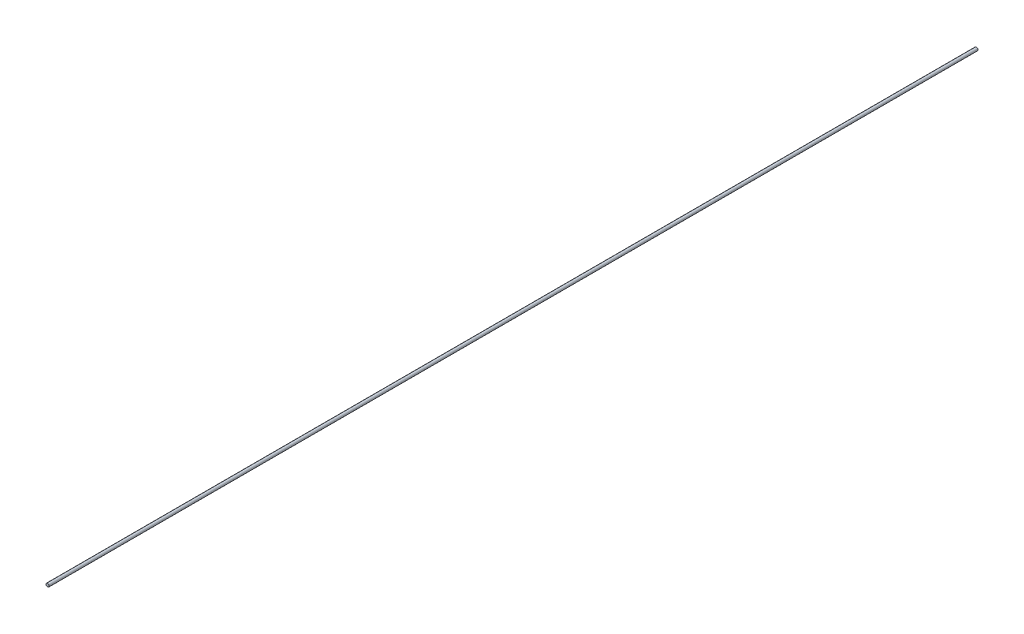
ISO-10303-21;
HEADER;
FILE_DESCRIPTION(('STEP AP214'),'2;1');
FILE_NAME('part.step','',(''),(''),'','','');
FILE_SCHEMA(('AUTOMOTIVE_DESIGN { 1 0 10303 214 1 1 1 1 }'));
ENDSEC;
DATA;
#1=APPLICATION_CONTEXT('core data for automotive mechanical design processes');
#2=APPLICATION_PROTOCOL_DEFINITION('international standard','automotive_design',2000,#1);
#3=PRODUCT_CONTEXT('',#1,'mechanical');
#4=PRODUCT('Part','Part','',(#3));
#5=PRODUCT_RELATED_PRODUCT_CATEGORY('part','',(#4));
#6=PRODUCT_DEFINITION_FORMATION('','',#4);
#7=PRODUCT_DEFINITION_CONTEXT('part definition',#1,'design');
#8=PRODUCT_DEFINITION('design','',#6,#7);
#9=PRODUCT_DEFINITION_SHAPE('','',#8);
#10=(LENGTH_UNIT() NAMED_UNIT(*) SI_UNIT(.MILLI.,.METRE.));
#11=(NAMED_UNIT(*) PLANE_ANGLE_UNIT() SI_UNIT($,.RADIAN.));
#12=(NAMED_UNIT(*) SI_UNIT($,.STERADIAN.) SOLID_ANGLE_UNIT());
#13=UNCERTAINTY_MEASURE_WITH_UNIT(LENGTH_MEASURE(1.E-05),#10,'distance_accuracy_value','');
#14=(GEOMETRIC_REPRESENTATION_CONTEXT(3) GLOBAL_UNCERTAINTY_ASSIGNED_CONTEXT((#13)) GLOBAL_UNIT_ASSIGNED_CONTEXT((#10,
#11,#12)) REPRESENTATION_CONTEXT('',''));
#15=CARTESIAN_POINT('',(0.,0.,0.));
#16=DIRECTION('',(0.,0.,1.));
#17=DIRECTION('',(1.,0.,0.));
#18=AXIS2_PLACEMENT_3D('',#15,#16,#17);
#19=CARTESIAN_POINT('',(0.,0.,914.4));
#20=DIRECTION('',(0.,0.,-1.));
#21=DIRECTION('',(-1.,0.,0.));
#22=AXIS2_PLACEMENT_3D('',#19,#20,#21);
#23=CYLINDRICAL_SURFACE('',#22,1.5875);
#24=CARTESIAN_POINT('',(0.,0.,914.4));
#25=DIRECTION('',(0.,0.,1.));
#26=DIRECTION('',(1.,0.,0.));
#27=AXIS2_PLACEMENT_3D('',#24,#25,#26);
#28=CIRCLE('',#27,1.5875);
#29=CARTESIAN_POINT('',(1.5875,0.,914.4));
#30=VERTEX_POINT('',#29);
#31=EDGE_CURVE('E10',#30,#30,#28,.T.);
#32=ORIENTED_EDGE('',*,*,#31,.F.);
#33=EDGE_LOOP('',(#32));
#34=FACE_BOUND('',#33,.T.);
#35=CARTESIAN_POINT('',(0.,0.,0.));
#36=DIRECTION('',(0.,0.,1.));
#37=DIRECTION('',(1.,0.,0.));
#38=AXIS2_PLACEMENT_3D('',#35,#36,#37);
#39=CIRCLE('',#38,1.5875);
#40=CARTESIAN_POINT('',(1.5875,0.,0.));
#41=VERTEX_POINT('',#40);
#42=EDGE_CURVE('E33',#41,#41,#39,.T.);
#43=ORIENTED_EDGE('',*,*,#42,.T.);
#44=EDGE_LOOP('',(#43));
#45=FACE_BOUND('',#44,.T.);
#46=ADVANCED_FACE('F27',(#34,#45),#23,.T.);
#47=CARTESIAN_POINT('',(0.,0.,914.4));
#48=DIRECTION('',(0.,0.,1.));
#49=DIRECTION('',(1.,0.,0.));
#50=AXIS2_PLACEMENT_3D('',#47,#48,#49);
#51=PLANE('',#50);
#52=ORIENTED_EDGE('',*,*,#31,.T.);
#53=EDGE_LOOP('',(#52));
#54=FACE_BOUND('',#53,.T.);
#55=ADVANCED_FACE('F42',(#54),#51,.T.);
#56=CARTESIAN_POINT('',(0.,0.,0.));
#57=DIRECTION('',(0.,0.,1.));
#58=DIRECTION('',(1.,0.,0.));
#59=AXIS2_PLACEMENT_3D('',#56,#57,#58);
#60=PLANE('',#59);
#61=ORIENTED_EDGE('',*,*,#42,.F.);
#62=EDGE_LOOP('',(#61));
#63=FACE_BOUND('',#62,.T.);
#64=ADVANCED_FACE('F40',(#63),#60,.F.);
#65=CLOSED_SHELL('',(#46,#55,#64));
#66=MANIFOLD_SOLID_BREP('B2',#65);
#67=ADVANCED_BREP_SHAPE_REPRESENTATION('',(#18,#66),#14);
#68=SHAPE_DEFINITION_REPRESENTATION(#9,#67);
ENDSEC;
END-ISO-10303-21;
